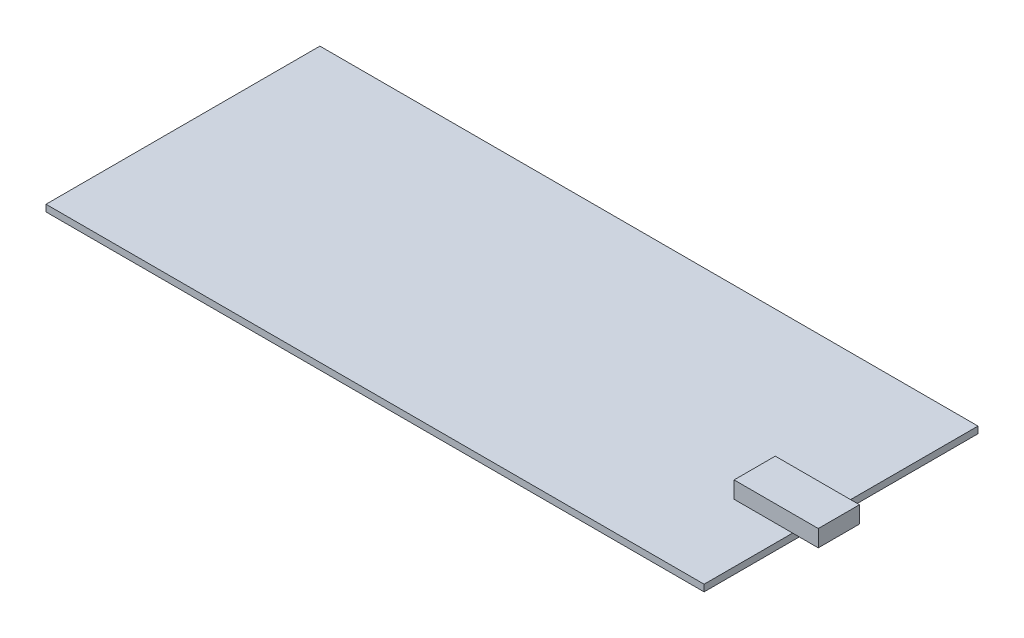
ISO-10303-21;
HEADER;
FILE_DESCRIPTION(('STEP AP214'),'2;1');
FILE_NAME('part.step','',(''),(''),'','','');
FILE_SCHEMA(('AUTOMOTIVE_DESIGN { 1 0 10303 214 1 1 1 1 }'));
ENDSEC;
DATA;
#1=APPLICATION_CONTEXT('core data for automotive mechanical design processes');
#2=APPLICATION_PROTOCOL_DEFINITION('international standard','automotive_design',2000,#1);
#3=PRODUCT_CONTEXT('',#1,'mechanical');
#4=PRODUCT('Part','Part','',(#3));
#5=PRODUCT_RELATED_PRODUCT_CATEGORY('part','',(#4));
#6=PRODUCT_DEFINITION_FORMATION('','',#4);
#7=PRODUCT_DEFINITION_CONTEXT('part definition',#1,'design');
#8=PRODUCT_DEFINITION('design','',#6,#7);
#9=PRODUCT_DEFINITION_SHAPE('','',#8);
#10=(LENGTH_UNIT() NAMED_UNIT(*) SI_UNIT(.MILLI.,.METRE.));
#11=(NAMED_UNIT(*) PLANE_ANGLE_UNIT() SI_UNIT($,.RADIAN.));
#12=(NAMED_UNIT(*) SI_UNIT($,.STERADIAN.) SOLID_ANGLE_UNIT());
#13=UNCERTAINTY_MEASURE_WITH_UNIT(LENGTH_MEASURE(1.E-05),#10,'distance_accuracy_value','');
#14=(GEOMETRIC_REPRESENTATION_CONTEXT(3) GLOBAL_UNCERTAINTY_ASSIGNED_CONTEXT((#13)) GLOBAL_UNIT_ASSIGNED_CONTEXT((#10,
#11,#12)) REPRESENTATION_CONTEXT('',''));
#15=CARTESIAN_POINT('',(0.,0.,0.));
#16=DIRECTION('',(0.,0.,1.));
#17=DIRECTION('',(1.,0.,0.));
#18=AXIS2_PLACEMENT_3D('',#15,#16,#17);
#19=CARTESIAN_POINT('',(0.,2.,-81.99));
#20=DIRECTION('',(1.,0.,0.));
#21=DIRECTION('',(0.,0.,-1.));
#22=AXIS2_PLACEMENT_3D('',#19,#20,#21);
#23=PLANE('',#22);
#24=DIRECTION('',(0.,0.,1.));
#25=VECTOR('',#24,1.);
#26=CARTESIAN_POINT('',(0.,0.,-81.99));
#27=LINE('',#26,#25);
#28=CARTESIAN_POINT('',(0.,0.,-81.99));
#29=VERTEX_POINT('',#28);
#30=CARTESIAN_POINT('',(0.,0.,0.));
#31=VERTEX_POINT('',#30);
#32=EDGE_CURVE('E138',#29,#31,#27,.T.);
#33=ORIENTED_EDGE('',*,*,#32,.T.);
#34=DIRECTION('',(0.,-1.,0.));
#35=VECTOR('',#34,1.);
#36=CARTESIAN_POINT('',(0.,2.,0.));
#37=LINE('',#36,#35);
#38=CARTESIAN_POINT('',(0.,2.,0.));
#39=VERTEX_POINT('',#38);
#40=EDGE_CURVE('E46',#39,#31,#37,.T.);
#41=ORIENTED_EDGE('',*,*,#40,.F.);
#42=DIRECTION('',(0.,0.,1.));
#43=VECTOR('',#42,1.);
#44=CARTESIAN_POINT('',(0.,2.,-81.99));
#45=LINE('',#44,#43);
#46=CARTESIAN_POINT('',(0.,2.,-81.99));
#47=VERTEX_POINT('',#46);
#48=EDGE_CURVE('E149',#47,#39,#45,.T.);
#49=ORIENTED_EDGE('',*,*,#48,.F.);
#50=DIRECTION('',(0.,-1.,0.));
#51=VECTOR('',#50,1.);
#52=CARTESIAN_POINT('',(0.,2.,-81.99));
#53=LINE('',#52,#51);
#54=EDGE_CURVE('E167',#47,#29,#53,.T.);
#55=ORIENTED_EDGE('',*,*,#54,.T.);
#56=EDGE_LOOP('',(#33,#41,#49,#55));
#57=FACE_BOUND('',#56,.T.);
#58=ADVANCED_FACE('F43',(#57),#23,.F.);
#59=CARTESIAN_POINT('',(0.,2.,0.));
#60=DIRECTION('',(0.,0.,-1.));
#61=DIRECTION('',(-1.,0.,0.));
#62=AXIS2_PLACEMENT_3D('',#59,#60,#61);
#63=PLANE('',#62);
#64=DIRECTION('',(1.,0.,0.));
#65=VECTOR('',#64,1.);
#66=CARTESIAN_POINT('',(0.,0.,0.));
#67=LINE('',#66,#65);
#68=CARTESIAN_POINT('',(197.,0.,0.));
#69=VERTEX_POINT('',#68);
#70=EDGE_CURVE('E143',#31,#69,#67,.T.);
#71=ORIENTED_EDGE('',*,*,#70,.T.);
#72=DIRECTION('',(0.,-1.,0.));
#73=VECTOR('',#72,1.);
#74=CARTESIAN_POINT('',(197.,2.,0.));
#75=LINE('',#74,#73);
#76=CARTESIAN_POINT('',(197.,2.,0.));
#77=VERTEX_POINT('',#76);
#78=EDGE_CURVE('E183',#77,#69,#75,.T.);
#79=ORIENTED_EDGE('',*,*,#78,.F.);
#80=DIRECTION('',(1.,0.,0.));
#81=VECTOR('',#80,1.);
#82=CARTESIAN_POINT('',(0.,2.,0.));
#83=LINE('',#82,#81);
#84=EDGE_CURVE('E153',#39,#77,#83,.T.);
#85=ORIENTED_EDGE('',*,*,#84,.F.);
#86=ORIENTED_EDGE('',*,*,#40,.T.);
#87=EDGE_LOOP('',(#71,#79,#85,#86));
#88=FACE_BOUND('',#87,.T.);
#89=ADVANCED_FACE('F192',(#88),#63,.F.);
#90=CARTESIAN_POINT('',(197.,2.,-81.99));
#91=DIRECTION('',(1.,0.,0.));
#92=DIRECTION('',(0.,0.,-1.));
#93=AXIS2_PLACEMENT_3D('',#90,#91,#92);
#94=PLANE('',#93);
#95=DIRECTION('',(0.,0.,1.));
#96=VECTOR('',#95,1.);
#97=CARTESIAN_POINT('',(197.,0.,-81.99));
#98=LINE('',#97,#96);
#99=CARTESIAN_POINT('',(197.,0.,-81.99));
#100=VERTEX_POINT('',#99);
#101=EDGE_CURVE('E172',#100,#69,#98,.T.);
#102=ORIENTED_EDGE('',*,*,#101,.F.);
#103=DIRECTION('',(0.,-1.,0.));
#104=VECTOR('',#103,1.);
#105=CARTESIAN_POINT('',(197.,2.,-81.99));
#106=LINE('',#105,#104);
#107=CARTESIAN_POINT('',(197.,2.,-81.99));
#108=VERTEX_POINT('',#107);
#109=EDGE_CURVE('E181',#108,#100,#106,.T.);
#110=ORIENTED_EDGE('',*,*,#109,.F.);
#111=DIRECTION('',(0.,0.,1.));
#112=VECTOR('',#111,1.);
#113=CARTESIAN_POINT('',(197.,2.,-81.99));
#114=LINE('',#113,#112);
#115=CARTESIAN_POINT('',(197.,2.,-38.825));
#116=VERTEX_POINT('',#115);
#117=EDGE_CURVE('E159',#108,#116,#114,.T.);
#118=ORIENTED_EDGE('',*,*,#117,.T.);
#119=CARTESIAN_POINT('',(197.,2.,-26.5));
#120=VERTEX_POINT('',#119);
#121=EDGE_CURVE('E164',#116,#120,#114,.T.);
#122=ORIENTED_EDGE('',*,*,#121,.T.);
#123=EDGE_CURVE('E158',#120,#77,#114,.T.);
#124=ORIENTED_EDGE('',*,*,#123,.T.);
#125=ORIENTED_EDGE('',*,*,#78,.T.);
#126=EDGE_LOOP('',(#102,#110,#118,#122,#124,#125));
#127=FACE_BOUND('',#126,.T.);
#128=ADVANCED_FACE('F203',(#127),#94,.T.);
#129=CARTESIAN_POINT('',(0.,2.,-81.99));
#130=DIRECTION('',(0.,0.,-1.));
#131=DIRECTION('',(-1.,0.,0.));
#132=AXIS2_PLACEMENT_3D('',#129,#130,#131);
#133=PLANE('',#132);
#134=DIRECTION('',(1.,0.,0.));
#135=VECTOR('',#134,1.);
#136=CARTESIAN_POINT('',(0.,0.,-81.99));
#137=LINE('',#136,#135);
#138=EDGE_CURVE('E154',#29,#100,#137,.T.);
#139=ORIENTED_EDGE('',*,*,#138,.F.);
#140=ORIENTED_EDGE('',*,*,#54,.F.);
#141=DIRECTION('',(1.,0.,0.));
#142=VECTOR('',#141,1.);
#143=CARTESIAN_POINT('',(0.,2.,-81.99));
#144=LINE('',#143,#142);
#145=EDGE_CURVE('E163',#47,#108,#144,.T.);
#146=ORIENTED_EDGE('',*,*,#145,.T.);
#147=ORIENTED_EDGE('',*,*,#109,.T.);
#148=EDGE_LOOP('',(#139,#140,#146,#147));
#149=FACE_BOUND('',#148,.T.);
#150=ADVANCED_FACE('F200',(#149),#133,.T.);
#151=CARTESIAN_POINT('',(0.,2.,0.));
#152=DIRECTION('',(0.,1.,0.));
#153=DIRECTION('',(0.,0.,1.));
#154=AXIS2_PLACEMENT_3D('',#151,#152,#153);
#155=PLANE('',#154);
#156=DIRECTION('',(-1.,0.,0.));
#157=VECTOR('',#156,1.);
#158=CARTESIAN_POINT('',(179.481368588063,2.,-38.825));
#159=LINE('',#158,#157);
#160=CARTESIAN_POINT('',(179.481368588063,2.,-38.825));
#161=VERTEX_POINT('',#160);
#162=EDGE_CURVE('E11',#116,#161,#159,.T.);
#163=ORIENTED_EDGE('',*,*,#162,.F.);
#164=ORIENTED_EDGE('',*,*,#117,.F.);
#165=ORIENTED_EDGE('',*,*,#145,.F.);
#166=ORIENTED_EDGE('',*,*,#48,.T.);
#167=ORIENTED_EDGE('',*,*,#84,.T.);
#168=ORIENTED_EDGE('',*,*,#123,.F.);
#169=DIRECTION('',(1.,0.,0.));
#170=VECTOR('',#169,1.);
#171=CARTESIAN_POINT('',(179.481368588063,2.,-26.5));
#172=LINE('',#171,#170);
#173=CARTESIAN_POINT('',(179.481368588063,2.,-26.5));
#174=VERTEX_POINT('',#173);
#175=EDGE_CURVE('E64',#174,#120,#172,.T.);
#176=ORIENTED_EDGE('',*,*,#175,.F.);
#177=DIRECTION('',(0.,0.,1.));
#178=VECTOR('',#177,1.);
#179=CARTESIAN_POINT('',(179.481368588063,2.,-38.825));
#180=LINE('',#179,#178);
#181=EDGE_CURVE('E60',#161,#174,#180,.T.);
#182=ORIENTED_EDGE('',*,*,#181,.F.);
#183=EDGE_LOOP('',(#163,#164,#165,#166,#167,#168,#176,#182));
#184=FACE_BOUND('',#183,.T.);
#185=ADVANCED_FACE('F210',(#184),#155,.T.);
#186=CARTESIAN_POINT('',(0.,0.,0.));
#187=DIRECTION('',(0.,1.,0.));
#188=DIRECTION('',(0.,0.,1.));
#189=AXIS2_PLACEMENT_3D('',#186,#187,#188);
#190=PLANE('',#189);
#191=ORIENTED_EDGE('',*,*,#32,.F.);
#192=ORIENTED_EDGE('',*,*,#138,.T.);
#193=ORIENTED_EDGE('',*,*,#101,.T.);
#194=ORIENTED_EDGE('',*,*,#70,.F.);
#195=EDGE_LOOP('',(#191,#192,#193,#194));
#196=FACE_BOUND('',#195,.T.);
#197=ADVANCED_FACE('F198',(#196),#190,.F.);
#198=CARTESIAN_POINT('',(179.481368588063,7.025,-38.825));
#199=DIRECTION('',(1.,0.,0.));
#200=DIRECTION('',(0.,0.,-1.));
#201=AXIS2_PLACEMENT_3D('',#198,#199,#200);
#202=PLANE('',#201);
#203=ORIENTED_EDGE('',*,*,#181,.T.);
#204=DIRECTION('',(0.,-1.,0.));
#205=VECTOR('',#204,1.);
#206=CARTESIAN_POINT('',(179.481368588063,7.025,-26.5));
#207=LINE('',#206,#205);
#208=CARTESIAN_POINT('',(179.481368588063,7.025,-26.5));
#209=VERTEX_POINT('',#208);
#210=EDGE_CURVE('E118',#209,#174,#207,.T.);
#211=ORIENTED_EDGE('',*,*,#210,.F.);
#212=DIRECTION('',(0.,0.,1.));
#213=VECTOR('',#212,1.);
#214=CARTESIAN_POINT('',(179.481368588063,7.025,-38.825));
#215=LINE('',#214,#213);
#216=CARTESIAN_POINT('',(179.481368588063,7.025,-38.825));
#217=VERTEX_POINT('',#216);
#218=EDGE_CURVE('E125',#217,#209,#215,.T.);
#219=ORIENTED_EDGE('',*,*,#218,.F.);
#220=DIRECTION('',(0.,-1.,0.));
#221=VECTOR('',#220,1.);
#222=CARTESIAN_POINT('',(179.481368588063,7.025,-38.825));
#223=LINE('',#222,#221);
#224=EDGE_CURVE('E344',#217,#161,#223,.T.);
#225=ORIENTED_EDGE('',*,*,#224,.T.);
#226=EDGE_LOOP('',(#203,#211,#219,#225));
#227=FACE_BOUND('',#226,.T.);
#228=ADVANCED_FACE('F136',(#227),#202,.F.);
#229=CARTESIAN_POINT('',(179.481368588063,7.025,-26.5));
#230=DIRECTION('',(0.,0.,-1.));
#231=DIRECTION('',(-1.,0.,0.));
#232=AXIS2_PLACEMENT_3D('',#229,#230,#231);
#233=PLANE('',#232);
#234=ORIENTED_EDGE('',*,*,#175,.T.);
#235=CARTESIAN_POINT('',(204.677654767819,2.,-26.5));
#236=VERTEX_POINT('',#235);
#237=EDGE_CURVE('E334',#120,#236,#172,.T.);
#238=ORIENTED_EDGE('',*,*,#237,.T.);
#239=DIRECTION('',(0.,-1.,0.));
#240=VECTOR('',#239,1.);
#241=CARTESIAN_POINT('',(204.677654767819,7.025,-26.5));
#242=LINE('',#241,#240);
#243=CARTESIAN_POINT('',(204.677654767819,7.025,-26.5));
#244=VERTEX_POINT('',#243);
#245=EDGE_CURVE('E120',#244,#236,#242,.T.);
#246=ORIENTED_EDGE('',*,*,#245,.F.);
#247=DIRECTION('',(1.,0.,0.));
#248=VECTOR('',#247,1.);
#249=CARTESIAN_POINT('',(179.481368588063,7.025,-26.5));
#250=LINE('',#249,#248);
#251=EDGE_CURVE('E114',#209,#244,#250,.T.);
#252=ORIENTED_EDGE('',*,*,#251,.F.);
#253=ORIENTED_EDGE('',*,*,#210,.T.);
#254=EDGE_LOOP('',(#234,#238,#246,#252,#253));
#255=FACE_BOUND('',#254,.T.);
#256=ADVANCED_FACE('F116',(#255),#233,.F.);
#257=CARTESIAN_POINT('',(204.677654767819,7.025,-38.825));
#258=DIRECTION('',(-1.,0.,0.));
#259=DIRECTION('',(0.,0.,1.));
#260=AXIS2_PLACEMENT_3D('',#257,#258,#259);
#261=PLANE('',#260);
#262=DIRECTION('',(0.,0.,-1.));
#263=VECTOR('',#262,1.);
#264=CARTESIAN_POINT('',(204.677654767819,2.,-38.825));
#265=LINE('',#264,#263);
#266=CARTESIAN_POINT('',(204.677654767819,2.,-38.825));
#267=VERTEX_POINT('',#266);
#268=EDGE_CURVE('E339',#236,#267,#265,.T.);
#269=ORIENTED_EDGE('',*,*,#268,.T.);
#270=DIRECTION('',(0.,-1.,0.));
#271=VECTOR('',#270,1.);
#272=CARTESIAN_POINT('',(204.677654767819,7.025,-38.825));
#273=LINE('',#272,#271);
#274=CARTESIAN_POINT('',(204.677654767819,7.025,-38.825));
#275=VERTEX_POINT('',#274);
#276=EDGE_CURVE('E145',#275,#267,#273,.T.);
#277=ORIENTED_EDGE('',*,*,#276,.F.);
#278=DIRECTION('',(0.,0.,-1.));
#279=VECTOR('',#278,1.);
#280=CARTESIAN_POINT('',(204.677654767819,7.025,-38.825));
#281=LINE('',#280,#279);
#282=EDGE_CURVE('E124',#244,#275,#281,.T.);
#283=ORIENTED_EDGE('',*,*,#282,.F.);
#284=ORIENTED_EDGE('',*,*,#245,.T.);
#285=EDGE_LOOP('',(#269,#277,#283,#284));
#286=FACE_BOUND('',#285,.T.);
#287=ADVANCED_FACE('F268',(#286),#261,.F.);
#288=CARTESIAN_POINT('',(179.481368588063,7.025,-38.825));
#289=DIRECTION('',(0.,0.,1.));
#290=DIRECTION('',(1.,0.,0.));
#291=AXIS2_PLACEMENT_3D('',#288,#289,#290);
#292=PLANE('',#291);
#293=EDGE_CURVE('E53',#267,#116,#159,.T.);
#294=ORIENTED_EDGE('',*,*,#293,.T.);
#295=ORIENTED_EDGE('',*,*,#162,.T.);
#296=ORIENTED_EDGE('',*,*,#224,.F.);
#297=DIRECTION('',(-1.,0.,0.));
#298=VECTOR('',#297,1.);
#299=CARTESIAN_POINT('',(179.481368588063,7.025,-38.825));
#300=LINE('',#299,#298);
#301=EDGE_CURVE('E130',#275,#217,#300,.T.);
#302=ORIENTED_EDGE('',*,*,#301,.F.);
#303=ORIENTED_EDGE('',*,*,#276,.T.);
#304=EDGE_LOOP('',(#294,#295,#296,#302,#303));
#305=FACE_BOUND('',#304,.T.);
#306=ADVANCED_FACE('F278',(#305),#292,.F.);
#307=CARTESIAN_POINT('',(0.,7.025,0.));
#308=DIRECTION('',(0.,1.,0.));
#309=DIRECTION('',(0.,0.,1.));
#310=AXIS2_PLACEMENT_3D('',#307,#308,#309);
#311=PLANE('',#310);
#312=ORIENTED_EDGE('',*,*,#218,.T.);
#313=ORIENTED_EDGE('',*,*,#251,.T.);
#314=ORIENTED_EDGE('',*,*,#282,.T.);
#315=ORIENTED_EDGE('',*,*,#301,.T.);
#316=EDGE_LOOP('',(#312,#313,#314,#315));
#317=FACE_BOUND('',#316,.T.);
#318=ADVANCED_FACE('F128',(#317),#311,.T.);
#319=CARTESIAN_POINT('',(0.,2.,0.));
#320=DIRECTION('',(0.,1.,0.));
#321=DIRECTION('',(0.,0.,1.));
#322=AXIS2_PLACEMENT_3D('',#319,#320,#321);
#323=PLANE('',#322);
#324=ORIENTED_EDGE('',*,*,#121,.F.);
#325=ORIENTED_EDGE('',*,*,#293,.F.);
#326=ORIENTED_EDGE('',*,*,#268,.F.);
#327=ORIENTED_EDGE('',*,*,#237,.F.);
#328=EDGE_LOOP('',(#324,#325,#326,#327));
#329=FACE_BOUND('',#328,.T.);
#330=ADVANCED_FACE('F299',(#329),#323,.F.);
#331=CLOSED_SHELL('',(#58,#89,#128,#150,#185,#197,#228,#256,#287,#306,#318,#330));
#332=MANIFOLD_SOLID_BREP('B2',#331);
#333=ADVANCED_BREP_SHAPE_REPRESENTATION('',(#18,#332),#14);
#334=SHAPE_DEFINITION_REPRESENTATION(#9,#333);
ENDSEC;
END-ISO-10303-21;
